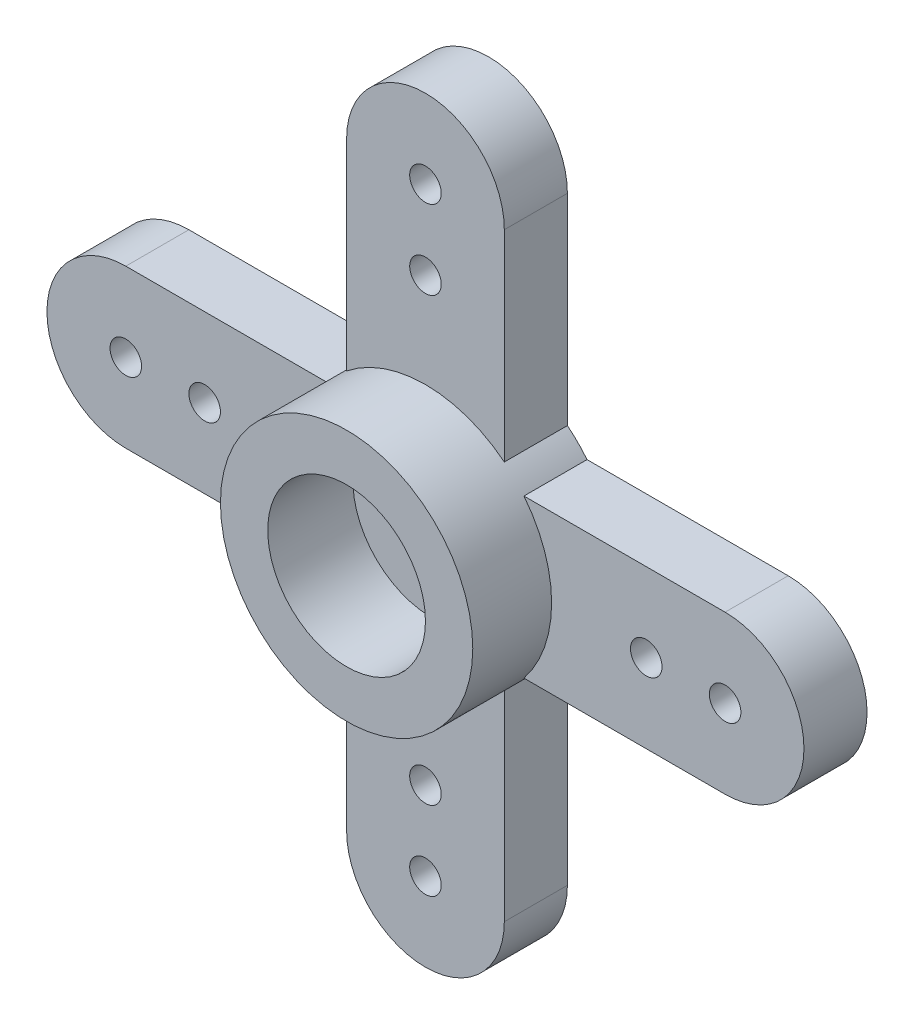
ISO-10303-21;
HEADER;
FILE_DESCRIPTION(('STEP AP214'),'2;1');
FILE_NAME('part.step','',(''),(''),'','','');
FILE_SCHEMA(('AUTOMOTIVE_DESIGN { 1 0 10303 214 1 1 1 1 }'));
ENDSEC;
DATA;
#1=APPLICATION_CONTEXT('core data for automotive mechanical design processes');
#2=APPLICATION_PROTOCOL_DEFINITION('international standard','automotive_design',2000,#1);
#3=PRODUCT_CONTEXT('',#1,'mechanical');
#4=PRODUCT('Part','Part','',(#3));
#5=PRODUCT_RELATED_PRODUCT_CATEGORY('part','',(#4));
#6=PRODUCT_DEFINITION_FORMATION('','',#4);
#7=PRODUCT_DEFINITION_CONTEXT('part definition',#1,'design');
#8=PRODUCT_DEFINITION('design','',#6,#7);
#9=PRODUCT_DEFINITION_SHAPE('','',#8);
#10=(LENGTH_UNIT() NAMED_UNIT(*) SI_UNIT(.MILLI.,.METRE.));
#11=(NAMED_UNIT(*) PLANE_ANGLE_UNIT() SI_UNIT($,.RADIAN.));
#12=(NAMED_UNIT(*) SI_UNIT($,.STERADIAN.) SOLID_ANGLE_UNIT());
#13=UNCERTAINTY_MEASURE_WITH_UNIT(LENGTH_MEASURE(1.E-05),#10,'distance_accuracy_value','');
#14=(GEOMETRIC_REPRESENTATION_CONTEXT(3) GLOBAL_UNCERTAINTY_ASSIGNED_CONTEXT((#13)) GLOBAL_UNIT_ASSIGNED_CONTEXT((#10,
#11,#12)) REPRESENTATION_CONTEXT('',''));
#15=CARTESIAN_POINT('',(0.,0.,0.));
#16=DIRECTION('',(0.,0.,1.));
#17=DIRECTION('',(1.,0.,0.));
#18=AXIS2_PLACEMENT_3D('',#15,#16,#17);
#19=CARTESIAN_POINT('',(0.,-9.5,2.));
#20=DIRECTION('',(0.,0.,1.));
#21=DIRECTION('',(1.,0.,0.));
#22=AXIS2_PLACEMENT_3D('',#19,#20,#21);
#23=PLANE('',#22);
#24=CARTESIAN_POINT('',(0.,0.,2.));
#25=DIRECTION('',(0.,0.,1.));
#26=DIRECTION('',(1.,0.,0.));
#27=AXIS2_PLACEMENT_3D('',#24,#25,#26);
#28=CIRCLE('',#27,4.);
#29=CARTESIAN_POINT('',(2.5,3.1224989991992,2.));
#30=VERTEX_POINT('',#29);
#31=CARTESIAN_POINT('',(-2.5,3.1224989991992,2.));
#32=VERTEX_POINT('',#31);
#33=EDGE_CURVE('E191',#30,#32,#28,.T.);
#34=ORIENTED_EDGE('',*,*,#33,.F.);
#35=DIRECTION('',(0.,1.,0.));
#36=VECTOR('',#35,1.);
#37=CARTESIAN_POINT('',(2.5,2.5,2.));
#38=LINE('',#37,#36);
#39=CARTESIAN_POINT('',(2.5,9.5,2.));
#40=VERTEX_POINT('',#39);
#41=EDGE_CURVE('E255',#30,#40,#38,.T.);
#42=ORIENTED_EDGE('',*,*,#41,.T.);
#43=CARTESIAN_POINT('',(0.,9.5,2.));
#44=DIRECTION('',(0.,0.,1.));
#45=DIRECTION('',(1.,0.,0.));
#46=AXIS2_PLACEMENT_3D('',#43,#44,#45);
#47=CIRCLE('',#46,2.5);
#48=CARTESIAN_POINT('',(-2.5,9.5,2.));
#49=VERTEX_POINT('',#48);
#50=EDGE_CURVE('E257',#40,#49,#47,.T.);
#51=ORIENTED_EDGE('',*,*,#50,.T.);
#52=DIRECTION('',(0.,-1.,0.));
#53=VECTOR('',#52,1.);
#54=CARTESIAN_POINT('',(-2.5,2.5,2.));
#55=LINE('',#54,#53);
#56=EDGE_CURVE('E259',#49,#32,#55,.T.);
#57=ORIENTED_EDGE('',*,*,#56,.T.);
#58=EDGE_LOOP('',(#34,#42,#51,#57));
#59=FACE_BOUND('',#58,.T.);
#60=CARTESIAN_POINT('',(0.,7.,2.));
#61=DIRECTION('',(0.,0.,1.));
#62=DIRECTION('',(1.,0.,0.));
#63=AXIS2_PLACEMENT_3D('',#60,#61,#62);
#64=CIRCLE('',#63,0.500000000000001);
#65=CARTESIAN_POINT('',(0.500000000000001,7.,2.));
#66=VERTEX_POINT('',#65);
#67=EDGE_CURVE('E211',#66,#66,#64,.T.);
#68=ORIENTED_EDGE('',*,*,#67,.F.);
#69=EDGE_LOOP('',(#68));
#70=FACE_BOUND('',#69,.T.);
#71=CARTESIAN_POINT('',(0.,9.5,2.));
#72=DIRECTION('',(0.,0.,1.));
#73=DIRECTION('',(1.,0.,0.));
#74=AXIS2_PLACEMENT_3D('',#71,#72,#73);
#75=CIRCLE('',#74,0.500000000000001);
#76=CARTESIAN_POINT('',(0.500000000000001,9.5,2.));
#77=VERTEX_POINT('',#76);
#78=EDGE_CURVE('E241',#77,#77,#75,.T.);
#79=ORIENTED_EDGE('',*,*,#78,.F.);
#80=EDGE_LOOP('',(#79));
#81=FACE_BOUND('',#80,.T.);
#82=ADVANCED_FACE('F34',(#59,#70,#81),#23,.T.);
#83=CARTESIAN_POINT('',(-3.1224989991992,2.5,2.));
#84=VERTEX_POINT('',#83);
#85=CARTESIAN_POINT('',(-3.1224989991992,-2.5,2.));
#86=VERTEX_POINT('',#85);
#87=EDGE_CURVE('E184',#84,#86,#28,.T.);
#88=ORIENTED_EDGE('',*,*,#87,.F.);
#89=DIRECTION('',(-1.,0.,0.));
#90=VECTOR('',#89,1.);
#91=CARTESIAN_POINT('',(-9.5,2.5,2.));
#92=LINE('',#91,#90);
#93=CARTESIAN_POINT('',(-9.5,2.5,2.));
#94=VERTEX_POINT('',#93);
#95=EDGE_CURVE('E262',#84,#94,#92,.T.);
#96=ORIENTED_EDGE('',*,*,#95,.T.);
#97=CARTESIAN_POINT('',(-9.5,0.,2.));
#98=DIRECTION('',(0.,0.,1.));
#99=DIRECTION('',(1.,0.,0.));
#100=AXIS2_PLACEMENT_3D('',#97,#98,#99);
#101=CIRCLE('',#100,2.5);
#102=CARTESIAN_POINT('',(-9.5,-2.5,2.));
#103=VERTEX_POINT('',#102);
#104=EDGE_CURVE('E264',#94,#103,#101,.T.);
#105=ORIENTED_EDGE('',*,*,#104,.T.);
#106=DIRECTION('',(1.,0.,0.));
#107=VECTOR('',#106,1.);
#108=CARTESIAN_POINT('',(-9.5,-2.5,2.));
#109=LINE('',#108,#107);
#110=EDGE_CURVE('E266',#103,#86,#109,.T.);
#111=ORIENTED_EDGE('',*,*,#110,.T.);
#112=EDGE_LOOP('',(#88,#96,#105,#111));
#113=FACE_BOUND('',#112,.T.);
#114=CARTESIAN_POINT('',(-7.,0.,2.));
#115=DIRECTION('',(0.,0.,1.));
#116=DIRECTION('',(1.,0.,0.));
#117=AXIS2_PLACEMENT_3D('',#114,#115,#116);
#118=CIRCLE('',#117,0.500000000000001);
#119=CARTESIAN_POINT('',(-6.5,0.,2.));
#120=VERTEX_POINT('',#119);
#121=EDGE_CURVE('E229',#120,#120,#118,.T.);
#122=ORIENTED_EDGE('',*,*,#121,.F.);
#123=EDGE_LOOP('',(#122));
#124=FACE_BOUND('',#123,.T.);
#125=CARTESIAN_POINT('',(-9.5,0.,2.));
#126=DIRECTION('',(0.,0.,1.));
#127=DIRECTION('',(1.,0.,0.));
#128=AXIS2_PLACEMENT_3D('',#125,#126,#127);
#129=CIRCLE('',#128,0.500000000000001);
#130=CARTESIAN_POINT('',(-9.,0.,2.));
#131=VERTEX_POINT('',#130);
#132=EDGE_CURVE('E235',#131,#131,#129,.T.);
#133=ORIENTED_EDGE('',*,*,#132,.F.);
#134=EDGE_LOOP('',(#133));
#135=FACE_BOUND('',#134,.T.);
#136=ADVANCED_FACE('F336',(#113,#124,#135),#23,.T.);
#137=CARTESIAN_POINT('',(-2.5,-3.1224989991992,2.));
#138=VERTEX_POINT('',#137);
#139=CARTESIAN_POINT('',(2.5,-3.1224989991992,2.));
#140=VERTEX_POINT('',#139);
#141=EDGE_CURVE('E175',#138,#140,#28,.T.);
#142=ORIENTED_EDGE('',*,*,#141,.F.);
#143=DIRECTION('',(0.,-1.,0.));
#144=VECTOR('',#143,1.);
#145=CARTESIAN_POINT('',(-2.5,-2.5,2.));
#146=LINE('',#145,#144);
#147=CARTESIAN_POINT('',(-2.5,-9.5,2.));
#148=VERTEX_POINT('',#147);
#149=EDGE_CURVE('E163',#138,#148,#146,.T.);
#150=ORIENTED_EDGE('',*,*,#149,.T.);
#151=CARTESIAN_POINT('',(0.,-9.5,2.));
#152=DIRECTION('',(0.,0.,1.));
#153=DIRECTION('',(1.,0.,0.));
#154=AXIS2_PLACEMENT_3D('',#151,#152,#153);
#155=CIRCLE('',#154,2.5);
#156=CARTESIAN_POINT('',(2.5,-9.5,2.));
#157=VERTEX_POINT('',#156);
#158=EDGE_CURVE('E270',#148,#157,#155,.T.);
#159=ORIENTED_EDGE('',*,*,#158,.T.);
#160=DIRECTION('',(0.,1.,0.));
#161=VECTOR('',#160,1.);
#162=CARTESIAN_POINT('',(2.5,-2.5,2.));
#163=LINE('',#162,#161);
#164=EDGE_CURVE('E246',#157,#140,#163,.T.);
#165=ORIENTED_EDGE('',*,*,#164,.T.);
#166=EDGE_LOOP('',(#142,#150,#159,#165));
#167=FACE_BOUND('',#166,.T.);
#168=CARTESIAN_POINT('',(0.,-9.5,2.));
#169=DIRECTION('',(0.,0.,1.));
#170=DIRECTION('',(1.,0.,0.));
#171=AXIS2_PLACEMENT_3D('',#168,#169,#170);
#172=CIRCLE('',#171,0.5);
#173=CARTESIAN_POINT('',(0.5,-9.5,2.));
#174=VERTEX_POINT('',#173);
#175=EDGE_CURVE('E199',#174,#174,#172,.T.);
#176=ORIENTED_EDGE('',*,*,#175,.F.);
#177=EDGE_LOOP('',(#176));
#178=FACE_BOUND('',#177,.T.);
#179=CARTESIAN_POINT('',(0.,-7.,2.));
#180=DIRECTION('',(0.,0.,1.));
#181=DIRECTION('',(1.,0.,0.));
#182=AXIS2_PLACEMENT_3D('',#179,#180,#181);
#183=CIRCLE('',#182,0.5);
#184=CARTESIAN_POINT('',(0.5,-7.,2.));
#185=VERTEX_POINT('',#184);
#186=EDGE_CURVE('E205',#185,#185,#183,.T.);
#187=ORIENTED_EDGE('',*,*,#186,.F.);
#188=EDGE_LOOP('',(#187));
#189=FACE_BOUND('',#188,.T.);
#190=ADVANCED_FACE('F379',(#167,#178,#189),#23,.T.);
#191=CARTESIAN_POINT('',(3.1224989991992,-2.5,2.));
#192=VERTEX_POINT('',#191);
#193=CARTESIAN_POINT('',(3.1224989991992,2.5,2.));
#194=VERTEX_POINT('',#193);
#195=EDGE_CURVE('E183',#192,#194,#28,.T.);
#196=ORIENTED_EDGE('',*,*,#195,.F.);
#197=DIRECTION('',(1.,0.,0.));
#198=VECTOR('',#197,1.);
#199=CARTESIAN_POINT('',(9.5,-2.5,2.));
#200=LINE('',#199,#198);
#201=CARTESIAN_POINT('',(9.5,-2.5,2.));
#202=VERTEX_POINT('',#201);
#203=EDGE_CURVE('E248',#192,#202,#200,.T.);
#204=ORIENTED_EDGE('',*,*,#203,.T.);
#205=CARTESIAN_POINT('',(9.5,0.,2.));
#206=DIRECTION('',(0.,0.,1.));
#207=DIRECTION('',(1.,0.,0.));
#208=AXIS2_PLACEMENT_3D('',#205,#206,#207);
#209=CIRCLE('',#208,2.5);
#210=CARTESIAN_POINT('',(9.5,2.5,2.));
#211=VERTEX_POINT('',#210);
#212=EDGE_CURVE('E250',#202,#211,#209,.T.);
#213=ORIENTED_EDGE('',*,*,#212,.T.);
#214=DIRECTION('',(-1.,0.,0.));
#215=VECTOR('',#214,1.);
#216=CARTESIAN_POINT('',(2.5,2.5,2.));
#217=LINE('',#216,#215);
#218=EDGE_CURVE('E252',#211,#194,#217,.T.);
#219=ORIENTED_EDGE('',*,*,#218,.T.);
#220=EDGE_LOOP('',(#196,#204,#213,#219));
#221=FACE_BOUND('',#220,.T.);
#222=CARTESIAN_POINT('',(9.5,0.,2.));
#223=DIRECTION('',(0.,0.,1.));
#224=DIRECTION('',(1.,0.,0.));
#225=AXIS2_PLACEMENT_3D('',#222,#223,#224);
#226=CIRCLE('',#225,0.500000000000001);
#227=CARTESIAN_POINT('',(10.,0.,2.));
#228=VERTEX_POINT('',#227);
#229=EDGE_CURVE('E217',#228,#228,#226,.T.);
#230=ORIENTED_EDGE('',*,*,#229,.F.);
#231=EDGE_LOOP('',(#230));
#232=FACE_BOUND('',#231,.T.);
#233=CARTESIAN_POINT('',(7.,0.,2.));
#234=DIRECTION('',(0.,0.,1.));
#235=DIRECTION('',(1.,0.,0.));
#236=AXIS2_PLACEMENT_3D('',#233,#234,#235);
#237=CIRCLE('',#236,0.500000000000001);
#238=CARTESIAN_POINT('',(7.5,0.,2.));
#239=VERTEX_POINT('',#238);
#240=EDGE_CURVE('E223',#239,#239,#237,.T.);
#241=ORIENTED_EDGE('',*,*,#240,.F.);
#242=EDGE_LOOP('',(#241));
#243=FACE_BOUND('',#242,.T.);
#244=ADVANCED_FACE('F375',(#221,#232,#243),#23,.T.);
#245=CARTESIAN_POINT('',(0.,-9.5,0.));
#246=DIRECTION('',(0.,0.,1.));
#247=DIRECTION('',(1.,0.,0.));
#248=AXIS2_PLACEMENT_3D('',#245,#246,#247);
#249=PLANE('',#248);
#250=CARTESIAN_POINT('',(9.5,0.,0.));
#251=DIRECTION('',(0.,0.,1.));
#252=DIRECTION('',(1.,0.,0.));
#253=AXIS2_PLACEMENT_3D('',#250,#251,#252);
#254=CIRCLE('',#253,0.500000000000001);
#255=CARTESIAN_POINT('',(10.,0.,0.));
#256=VERTEX_POINT('',#255);
#257=EDGE_CURVE('E214',#256,#256,#254,.T.);
#258=ORIENTED_EDGE('',*,*,#257,.T.);
#259=EDGE_LOOP('',(#258));
#260=FACE_BOUND('',#259,.T.);
#261=DIRECTION('',(1.,0.,0.));
#262=VECTOR('',#261,1.);
#263=CARTESIAN_POINT('',(9.5,-2.5,0.));
#264=LINE('',#263,#262);
#265=CARTESIAN_POINT('',(3.1224989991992,-2.5,0.));
#266=VERTEX_POINT('',#265);
#267=CARTESIAN_POINT('',(9.5,-2.5,0.));
#268=VERTEX_POINT('',#267);
#269=EDGE_CURVE('E274',#266,#268,#264,.T.);
#270=ORIENTED_EDGE('',*,*,#269,.F.);
#271=CARTESIAN_POINT('',(0.,0.,0.));
#272=DIRECTION('',(0.,0.,1.));
#273=DIRECTION('',(1.,0.,0.));
#274=AXIS2_PLACEMENT_3D('',#271,#272,#273);
#275=CIRCLE('',#274,4.);
#276=CARTESIAN_POINT('',(2.5,-3.1224989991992,0.));
#277=VERTEX_POINT('',#276);
#278=EDGE_CURVE('E171',#266,#277,#275,.F.);
#279=ORIENTED_EDGE('',*,*,#278,.T.);
#280=DIRECTION('',(0.,1.,0.));
#281=VECTOR('',#280,1.);
#282=CARTESIAN_POINT('',(2.5,-2.5,0.));
#283=LINE('',#282,#281);
#284=CARTESIAN_POINT('',(2.5,-9.5,0.));
#285=VERTEX_POINT('',#284);
#286=EDGE_CURVE('E54',#285,#277,#283,.T.);
#287=ORIENTED_EDGE('',*,*,#286,.F.);
#288=CARTESIAN_POINT('',(0.,-9.5,0.));
#289=DIRECTION('',(0.,0.,1.));
#290=DIRECTION('',(1.,0.,0.));
#291=AXIS2_PLACEMENT_3D('',#288,#289,#290);
#292=CIRCLE('',#291,2.5);
#293=CARTESIAN_POINT('',(-2.5,-9.5,0.));
#294=VERTEX_POINT('',#293);
#295=EDGE_CURVE('E154',#294,#285,#292,.T.);
#296=ORIENTED_EDGE('',*,*,#295,.F.);
#297=DIRECTION('',(0.,-1.,0.));
#298=VECTOR('',#297,1.);
#299=CARTESIAN_POINT('',(-2.5,-2.5,0.));
#300=LINE('',#299,#298);
#301=CARTESIAN_POINT('',(-2.5,-3.1224989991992,0.));
#302=VERTEX_POINT('',#301);
#303=EDGE_CURVE('E147',#302,#294,#300,.T.);
#304=ORIENTED_EDGE('',*,*,#303,.F.);
#305=CARTESIAN_POINT('',(-3.1224989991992,-2.5,0.));
#306=VERTEX_POINT('',#305);
#307=EDGE_CURVE('E153',#302,#306,#275,.F.);
#308=ORIENTED_EDGE('',*,*,#307,.T.);
#309=DIRECTION('',(1.,0.,0.));
#310=VECTOR('',#309,1.);
#311=CARTESIAN_POINT('',(-9.5,-2.5,0.));
#312=LINE('',#311,#310);
#313=CARTESIAN_POINT('',(-9.5,-2.5,0.));
#314=VERTEX_POINT('',#313);
#315=EDGE_CURVE('E158',#314,#306,#312,.T.);
#316=ORIENTED_EDGE('',*,*,#315,.F.);
#317=CARTESIAN_POINT('',(-9.5,0.,0.));
#318=DIRECTION('',(0.,0.,1.));
#319=DIRECTION('',(1.,0.,0.));
#320=AXIS2_PLACEMENT_3D('',#317,#318,#319);
#321=CIRCLE('',#320,2.5);
#322=CARTESIAN_POINT('',(-9.5,2.5,0.));
#323=VERTEX_POINT('',#322);
#324=EDGE_CURVE('E288',#323,#314,#321,.T.);
#325=ORIENTED_EDGE('',*,*,#324,.F.);
#326=DIRECTION('',(-1.,0.,0.));
#327=VECTOR('',#326,1.);
#328=CARTESIAN_POINT('',(-9.5,2.5,0.));
#329=LINE('',#328,#327);
#330=CARTESIAN_POINT('',(-3.1224989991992,2.5,0.));
#331=VERTEX_POINT('',#330);
#332=EDGE_CURVE('E286',#331,#323,#329,.T.);
#333=ORIENTED_EDGE('',*,*,#332,.F.);
#334=CARTESIAN_POINT('',(-2.5,3.1224989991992,0.));
#335=VERTEX_POINT('',#334);
#336=EDGE_CURVE('E172',#331,#335,#275,.F.);
#337=ORIENTED_EDGE('',*,*,#336,.T.);
#338=DIRECTION('',(0.,-1.,0.));
#339=VECTOR('',#338,1.);
#340=CARTESIAN_POINT('',(-2.5,2.5,0.));
#341=LINE('',#340,#339);
#342=CARTESIAN_POINT('',(-2.5,9.5,0.));
#343=VERTEX_POINT('',#342);
#344=EDGE_CURVE('E284',#343,#335,#341,.T.);
#345=ORIENTED_EDGE('',*,*,#344,.F.);
#346=CARTESIAN_POINT('',(0.,9.5,0.));
#347=DIRECTION('',(0.,0.,1.));
#348=DIRECTION('',(1.,0.,0.));
#349=AXIS2_PLACEMENT_3D('',#346,#347,#348);
#350=CIRCLE('',#349,2.5);
#351=CARTESIAN_POINT('',(2.5,9.5,0.));
#352=VERTEX_POINT('',#351);
#353=EDGE_CURVE('E282',#352,#343,#350,.T.);
#354=ORIENTED_EDGE('',*,*,#353,.F.);
#355=DIRECTION('',(0.,1.,0.));
#356=VECTOR('',#355,1.);
#357=CARTESIAN_POINT('',(2.5,2.5,0.));
#358=LINE('',#357,#356);
#359=CARTESIAN_POINT('',(2.5,3.1224989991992,0.));
#360=VERTEX_POINT('',#359);
#361=EDGE_CURVE('E280',#360,#352,#358,.T.);
#362=ORIENTED_EDGE('',*,*,#361,.F.);
#363=CARTESIAN_POINT('',(3.1224989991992,2.5,0.));
#364=VERTEX_POINT('',#363);
#365=EDGE_CURVE('E176',#360,#364,#275,.F.);
#366=ORIENTED_EDGE('',*,*,#365,.T.);
#367=DIRECTION('',(-1.,0.,0.));
#368=VECTOR('',#367,1.);
#369=CARTESIAN_POINT('',(2.5,2.5,0.));
#370=LINE('',#369,#368);
#371=CARTESIAN_POINT('',(9.5,2.5,0.));
#372=VERTEX_POINT('',#371);
#373=EDGE_CURVE('E278',#372,#364,#370,.T.);
#374=ORIENTED_EDGE('',*,*,#373,.F.);
#375=CARTESIAN_POINT('',(9.5,0.,0.));
#376=DIRECTION('',(0.,0.,1.));
#377=DIRECTION('',(1.,0.,0.));
#378=AXIS2_PLACEMENT_3D('',#375,#376,#377);
#379=CIRCLE('',#378,2.5);
#380=EDGE_CURVE('E276',#268,#372,#379,.T.);
#381=ORIENTED_EDGE('',*,*,#380,.F.);
#382=EDGE_LOOP('',(#270,#279,#287,#296,#304,#308,#316,#325,#333,#337,#345,#354,#362,#366,#374,#381));
#383=FACE_BOUND('',#382,.T.);
#384=CARTESIAN_POINT('',(7.,0.,0.));
#385=DIRECTION('',(0.,0.,1.));
#386=DIRECTION('',(1.,0.,0.));
#387=AXIS2_PLACEMENT_3D('',#384,#385,#386);
#388=CIRCLE('',#387,0.500000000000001);
#389=CARTESIAN_POINT('',(7.5,0.,0.));
#390=VERTEX_POINT('',#389);
#391=EDGE_CURVE('E220',#390,#390,#388,.T.);
#392=ORIENTED_EDGE('',*,*,#391,.T.);
#393=EDGE_LOOP('',(#392));
#394=FACE_BOUND('',#393,.T.);
#395=CARTESIAN_POINT('',(0.,-9.5,0.));
#396=DIRECTION('',(0.,0.,1.));
#397=DIRECTION('',(1.,0.,0.));
#398=AXIS2_PLACEMENT_3D('',#395,#396,#397);
#399=CIRCLE('',#398,0.5);
#400=CARTESIAN_POINT('',(0.5,-9.5,0.));
#401=VERTEX_POINT('',#400);
#402=EDGE_CURVE('E198',#401,#401,#399,.T.);
#403=ORIENTED_EDGE('',*,*,#402,.T.);
#404=EDGE_LOOP('',(#403));
#405=FACE_BOUND('',#404,.T.);
#406=CARTESIAN_POINT('',(0.,-7.,0.));
#407=DIRECTION('',(0.,0.,1.));
#408=DIRECTION('',(1.,0.,0.));
#409=AXIS2_PLACEMENT_3D('',#406,#407,#408);
#410=CIRCLE('',#409,0.5);
#411=CARTESIAN_POINT('',(0.5,-7.,0.));
#412=VERTEX_POINT('',#411);
#413=EDGE_CURVE('E202',#412,#412,#410,.T.);
#414=ORIENTED_EDGE('',*,*,#413,.T.);
#415=EDGE_LOOP('',(#414));
#416=FACE_BOUND('',#415,.T.);
#417=CARTESIAN_POINT('',(-7.,0.,0.));
#418=DIRECTION('',(0.,0.,1.));
#419=DIRECTION('',(1.,0.,0.));
#420=AXIS2_PLACEMENT_3D('',#417,#418,#419);
#421=CIRCLE('',#420,0.500000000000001);
#422=CARTESIAN_POINT('',(-6.5,0.,0.));
#423=VERTEX_POINT('',#422);
#424=EDGE_CURVE('E226',#423,#423,#421,.T.);
#425=ORIENTED_EDGE('',*,*,#424,.T.);
#426=EDGE_LOOP('',(#425));
#427=FACE_BOUND('',#426,.T.);
#428=CARTESIAN_POINT('',(-9.5,0.,0.));
#429=DIRECTION('',(0.,0.,1.));
#430=DIRECTION('',(1.,0.,0.));
#431=AXIS2_PLACEMENT_3D('',#428,#429,#430);
#432=CIRCLE('',#431,0.500000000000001);
#433=CARTESIAN_POINT('',(-9.,0.,0.));
#434=VERTEX_POINT('',#433);
#435=EDGE_CURVE('E232',#434,#434,#432,.T.);
#436=ORIENTED_EDGE('',*,*,#435,.T.);
#437=EDGE_LOOP('',(#436));
#438=FACE_BOUND('',#437,.T.);
#439=CARTESIAN_POINT('',(0.,7.,0.));
#440=DIRECTION('',(0.,0.,1.));
#441=DIRECTION('',(1.,0.,0.));
#442=AXIS2_PLACEMENT_3D('',#439,#440,#441);
#443=CIRCLE('',#442,0.500000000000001);
#444=CARTESIAN_POINT('',(0.500000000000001,7.,0.));
#445=VERTEX_POINT('',#444);
#446=EDGE_CURVE('E208',#445,#445,#443,.T.);
#447=ORIENTED_EDGE('',*,*,#446,.T.);
#448=EDGE_LOOP('',(#447));
#449=FACE_BOUND('',#448,.T.);
#450=CARTESIAN_POINT('',(0.,9.5,0.));
#451=DIRECTION('',(0.,0.,1.));
#452=DIRECTION('',(1.,0.,0.));
#453=AXIS2_PLACEMENT_3D('',#450,#451,#452);
#454=CIRCLE('',#453,0.500000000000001);
#455=CARTESIAN_POINT('',(0.500000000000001,9.5,0.));
#456=VERTEX_POINT('',#455);
#457=EDGE_CURVE('E238',#456,#456,#454,.T.);
#458=ORIENTED_EDGE('',*,*,#457,.T.);
#459=EDGE_LOOP('',(#458));
#460=FACE_BOUND('',#459,.T.);
#461=ADVANCED_FACE('F149',(#260,#383,#394,#405,#416,#427,#438,#449,#460),#249,.F.);
#462=CARTESIAN_POINT('',(2.5,-2.5,2.));
#463=DIRECTION('',(-1.,0.,0.));
#464=DIRECTION('',(0.,-1.,0.));
#465=AXIS2_PLACEMENT_3D('',#462,#463,#464);
#466=PLANE('',#465);
#467=ORIENTED_EDGE('',*,*,#286,.T.);
#468=DIRECTION('',(0.,0.,1.));
#469=VECTOR('',#468,1.);
#470=CARTESIAN_POINT('',(2.5,-3.1224989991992,-11.3137084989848));
#471=LINE('',#470,#469);
#472=EDGE_CURVE('E49',#277,#140,#471,.T.);
#473=ORIENTED_EDGE('',*,*,#472,.T.);
#474=ORIENTED_EDGE('',*,*,#164,.F.);
#475=DIRECTION('',(0.,0.,-1.));
#476=VECTOR('',#475,1.);
#477=CARTESIAN_POINT('',(2.5,-9.5,2.));
#478=LINE('',#477,#476);
#479=EDGE_CURVE('E272',#157,#285,#478,.T.);
#480=ORIENTED_EDGE('',*,*,#479,.T.);
#481=EDGE_LOOP('',(#467,#473,#474,#480));
#482=FACE_BOUND('',#481,.T.);
#483=ADVANCED_FACE('F36',(#482),#466,.F.);
#484=CARTESIAN_POINT('',(9.5,-2.5,2.));
#485=DIRECTION('',(0.,1.,0.));
#486=DIRECTION('',(0.,0.,1.));
#487=AXIS2_PLACEMENT_3D('',#484,#485,#486);
#488=PLANE('',#487);
#489=ORIENTED_EDGE('',*,*,#203,.F.);
#490=DIRECTION('',(0.,0.,1.));
#491=VECTOR('',#490,1.);
#492=CARTESIAN_POINT('',(3.1224989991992,-2.5,-11.3137084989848));
#493=LINE('',#492,#491);
#494=EDGE_CURVE('E196',#192,#266,#493,.F.);
#495=ORIENTED_EDGE('',*,*,#494,.T.);
#496=ORIENTED_EDGE('',*,*,#269,.T.);
#497=DIRECTION('',(0.,0.,-1.));
#498=VECTOR('',#497,1.);
#499=CARTESIAN_POINT('',(9.5,-2.5,2.));
#500=LINE('',#499,#498);
#501=EDGE_CURVE('E42',#202,#268,#500,.T.);
#502=ORIENTED_EDGE('',*,*,#501,.F.);
#503=EDGE_LOOP('',(#489,#495,#496,#502));
#504=FACE_BOUND('',#503,.T.);
#505=ADVANCED_FACE('F555',(#504),#488,.F.);
#506=CARTESIAN_POINT('',(9.5,0.,2.));
#507=DIRECTION('',(0.,0.,-1.));
#508=DIRECTION('',(-1.,0.,0.));
#509=AXIS2_PLACEMENT_3D('',#506,#507,#508);
#510=CYLINDRICAL_SURFACE('',#509,2.5);
#511=ORIENTED_EDGE('',*,*,#380,.T.);
#512=DIRECTION('',(0.,0.,-1.));
#513=VECTOR('',#512,1.);
#514=CARTESIAN_POINT('',(9.5,2.5,2.));
#515=LINE('',#514,#513);
#516=EDGE_CURVE('E307',#211,#372,#515,.T.);
#517=ORIENTED_EDGE('',*,*,#516,.F.);
#518=ORIENTED_EDGE('',*,*,#212,.F.);
#519=ORIENTED_EDGE('',*,*,#501,.T.);
#520=EDGE_LOOP('',(#511,#517,#518,#519));
#521=FACE_BOUND('',#520,.T.);
#522=ADVANCED_FACE('F314',(#521),#510,.T.);
#523=CARTESIAN_POINT('',(2.5,2.5,2.));
#524=DIRECTION('',(0.,-1.,0.));
#525=DIRECTION('',(1.,0.,0.));
#526=AXIS2_PLACEMENT_3D('',#523,#524,#525);
#527=PLANE('',#526);
#528=ORIENTED_EDGE('',*,*,#373,.T.);
#529=DIRECTION('',(0.,0.,1.));
#530=VECTOR('',#529,1.);
#531=CARTESIAN_POINT('',(3.1224989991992,2.5,-11.3137084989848));
#532=LINE('',#531,#530);
#533=EDGE_CURVE('E194',#364,#194,#532,.T.);
#534=ORIENTED_EDGE('',*,*,#533,.T.);
#535=ORIENTED_EDGE('',*,*,#218,.F.);
#536=ORIENTED_EDGE('',*,*,#516,.T.);
#537=EDGE_LOOP('',(#528,#534,#535,#536));
#538=FACE_BOUND('',#537,.T.);
#539=ADVANCED_FACE('F325',(#538),#527,.F.);
#540=CARTESIAN_POINT('',(2.5,2.5,2.));
#541=DIRECTION('',(-1.,0.,0.));
#542=DIRECTION('',(0.,0.,1.));
#543=AXIS2_PLACEMENT_3D('',#540,#541,#542);
#544=PLANE('',#543);
#545=ORIENTED_EDGE('',*,*,#41,.F.);
#546=DIRECTION('',(0.,0.,1.));
#547=VECTOR('',#546,1.);
#548=CARTESIAN_POINT('',(2.5,3.1224989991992,-11.3137084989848));
#549=LINE('',#548,#547);
#550=EDGE_CURVE('E192',#30,#360,#549,.F.);
#551=ORIENTED_EDGE('',*,*,#550,.T.);
#552=ORIENTED_EDGE('',*,*,#361,.T.);
#553=DIRECTION('',(0.,0.,-1.));
#554=VECTOR('',#553,1.);
#555=CARTESIAN_POINT('',(2.5,9.5,2.));
#556=LINE('',#555,#554);
#557=EDGE_CURVE('E304',#40,#352,#556,.T.);
#558=ORIENTED_EDGE('',*,*,#557,.F.);
#559=EDGE_LOOP('',(#545,#551,#552,#558));
#560=FACE_BOUND('',#559,.T.);
#561=ADVANCED_FACE('F364',(#560),#544,.F.);
#562=CARTESIAN_POINT('',(0.,9.5,2.));
#563=DIRECTION('',(0.,0.,-1.));
#564=DIRECTION('',(-1.,0.,0.));
#565=AXIS2_PLACEMENT_3D('',#562,#563,#564);
#566=CYLINDRICAL_SURFACE('',#565,2.5);
#567=ORIENTED_EDGE('',*,*,#353,.T.);
#568=DIRECTION('',(0.,0.,-1.));
#569=VECTOR('',#568,1.);
#570=CARTESIAN_POINT('',(-2.5,9.5,2.));
#571=LINE('',#570,#569);
#572=EDGE_CURVE('E301',#49,#343,#571,.T.);
#573=ORIENTED_EDGE('',*,*,#572,.F.);
#574=ORIENTED_EDGE('',*,*,#50,.F.);
#575=ORIENTED_EDGE('',*,*,#557,.T.);
#576=EDGE_LOOP('',(#567,#573,#574,#575));
#577=FACE_BOUND('',#576,.T.);
#578=ADVANCED_FACE('F361',(#577),#566,.T.);
#579=CARTESIAN_POINT('',(-2.5,2.5,2.));
#580=DIRECTION('',(1.,0.,0.));
#581=DIRECTION('',(0.,0.,-1.));
#582=AXIS2_PLACEMENT_3D('',#579,#580,#581);
#583=PLANE('',#582);
#584=ORIENTED_EDGE('',*,*,#344,.T.);
#585=DIRECTION('',(0.,0.,1.));
#586=VECTOR('',#585,1.);
#587=CARTESIAN_POINT('',(-2.5,3.1224989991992,-11.3137084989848));
#588=LINE('',#587,#586);
#589=EDGE_CURVE('E189',#335,#32,#588,.T.);
#590=ORIENTED_EDGE('',*,*,#589,.T.);
#591=ORIENTED_EDGE('',*,*,#56,.F.);
#592=ORIENTED_EDGE('',*,*,#572,.T.);
#593=EDGE_LOOP('',(#584,#590,#591,#592));
#594=FACE_BOUND('',#593,.T.);
#595=ADVANCED_FACE('F353',(#594),#583,.F.);
#596=CARTESIAN_POINT('',(-9.5,2.5,2.));
#597=DIRECTION('',(0.,-1.,0.));
#598=DIRECTION('',(1.,0.,0.));
#599=AXIS2_PLACEMENT_3D('',#596,#597,#598);
#600=PLANE('',#599);
#601=ORIENTED_EDGE('',*,*,#95,.F.);
#602=DIRECTION('',(0.,0.,1.));
#603=VECTOR('',#602,1.);
#604=CARTESIAN_POINT('',(-3.1224989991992,2.5,-11.3137084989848));
#605=LINE('',#604,#603);
#606=EDGE_CURVE('E187',#84,#331,#605,.F.);
#607=ORIENTED_EDGE('',*,*,#606,.T.);
#608=ORIENTED_EDGE('',*,*,#332,.T.);
#609=DIRECTION('',(0.,0.,-1.));
#610=VECTOR('',#609,1.);
#611=CARTESIAN_POINT('',(-9.5,2.5,2.));
#612=LINE('',#611,#610);
#613=EDGE_CURVE('E298',#94,#323,#612,.T.);
#614=ORIENTED_EDGE('',*,*,#613,.F.);
#615=EDGE_LOOP('',(#601,#607,#608,#614));
#616=FACE_BOUND('',#615,.T.);
#617=ADVANCED_FACE('F341',(#616),#600,.F.);
#618=CARTESIAN_POINT('',(-9.5,0.,2.));
#619=DIRECTION('',(0.,0.,-1.));
#620=DIRECTION('',(-1.,0.,0.));
#621=AXIS2_PLACEMENT_3D('',#618,#619,#620);
#622=CYLINDRICAL_SURFACE('',#621,2.5);
#623=ORIENTED_EDGE('',*,*,#324,.T.);
#624=DIRECTION('',(0.,0.,-1.));
#625=VECTOR('',#624,1.);
#626=CARTESIAN_POINT('',(-9.5,-2.5,2.));
#627=LINE('',#626,#625);
#628=EDGE_CURVE('E295',#103,#314,#627,.T.);
#629=ORIENTED_EDGE('',*,*,#628,.F.);
#630=ORIENTED_EDGE('',*,*,#104,.F.);
#631=ORIENTED_EDGE('',*,*,#613,.T.);
#632=EDGE_LOOP('',(#623,#629,#630,#631));
#633=FACE_BOUND('',#632,.T.);
#634=ADVANCED_FACE('F347',(#633),#622,.T.);
#635=CARTESIAN_POINT('',(-9.5,-2.5,2.));
#636=DIRECTION('',(0.,1.,0.));
#637=DIRECTION('',(-1.,0.,0.));
#638=AXIS2_PLACEMENT_3D('',#635,#636,#637);
#639=PLANE('',#638);
#640=ORIENTED_EDGE('',*,*,#315,.T.);
#641=DIRECTION('',(0.,0.,1.));
#642=VECTOR('',#641,1.);
#643=CARTESIAN_POINT('',(-3.1224989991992,-2.5,-11.3137084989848));
#644=LINE('',#643,#642);
#645=EDGE_CURVE('E170',#306,#86,#644,.T.);
#646=ORIENTED_EDGE('',*,*,#645,.T.);
#647=ORIENTED_EDGE('',*,*,#110,.F.);
#648=ORIENTED_EDGE('',*,*,#628,.T.);
#649=EDGE_LOOP('',(#640,#646,#647,#648));
#650=FACE_BOUND('',#649,.T.);
#651=ADVANCED_FACE('F349',(#650),#639,.F.);
#652=CARTESIAN_POINT('',(-2.5,-2.5,2.));
#653=DIRECTION('',(1.,0.,0.));
#654=DIRECTION('',(0.,1.,0.));
#655=AXIS2_PLACEMENT_3D('',#652,#653,#654);
#656=PLANE('',#655);
#657=ORIENTED_EDGE('',*,*,#149,.F.);
#658=DIRECTION('',(0.,0.,1.));
#659=VECTOR('',#658,1.);
#660=CARTESIAN_POINT('',(-2.5,-3.1224989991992,-11.3137084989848));
#661=LINE('',#660,#659);
#662=EDGE_CURVE('E11',#138,#302,#661,.F.);
#663=ORIENTED_EDGE('',*,*,#662,.T.);
#664=ORIENTED_EDGE('',*,*,#303,.T.);
#665=DIRECTION('',(0.,0.,-1.));
#666=VECTOR('',#665,1.);
#667=CARTESIAN_POINT('',(-2.5,-9.5,2.));
#668=LINE('',#667,#666);
#669=EDGE_CURVE('E293',#148,#294,#668,.T.);
#670=ORIENTED_EDGE('',*,*,#669,.F.);
#671=EDGE_LOOP('',(#657,#663,#664,#670));
#672=FACE_BOUND('',#671,.T.);
#673=ADVANCED_FACE('F162',(#672),#656,.F.);
#674=CARTESIAN_POINT('',(0.,-9.5,2.));
#675=DIRECTION('',(0.,0.,-1.));
#676=DIRECTION('',(-1.,0.,0.));
#677=AXIS2_PLACEMENT_3D('',#674,#675,#676);
#678=CYLINDRICAL_SURFACE('',#677,2.5);
#679=ORIENTED_EDGE('',*,*,#295,.T.);
#680=ORIENTED_EDGE('',*,*,#479,.F.);
#681=ORIENTED_EDGE('',*,*,#158,.F.);
#682=ORIENTED_EDGE('',*,*,#669,.T.);
#683=EDGE_LOOP('',(#679,#680,#681,#682));
#684=FACE_BOUND('',#683,.T.);
#685=ADVANCED_FACE('F417',(#684),#678,.T.);
#686=CARTESIAN_POINT('',(0.,9.5,2.));
#687=DIRECTION('',(0.,0.,-1.));
#688=DIRECTION('',(-1.,0.,0.));
#689=AXIS2_PLACEMENT_3D('',#686,#687,#688);
#690=CYLINDRICAL_SURFACE('',#689,0.500000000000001);
#691=ORIENTED_EDGE('',*,*,#78,.T.);
#692=EDGE_LOOP('',(#691));
#693=FACE_BOUND('',#692,.T.);
#694=ORIENTED_EDGE('',*,*,#457,.F.);
#695=EDGE_LOOP('',(#694));
#696=FACE_BOUND('',#695,.T.);
#697=ADVANCED_FACE('F414',(#693,#696),#690,.F.);
#698=CARTESIAN_POINT('',(-9.5,0.,2.));
#699=DIRECTION('',(0.,0.,-1.));
#700=DIRECTION('',(-1.,0.,0.));
#701=AXIS2_PLACEMENT_3D('',#698,#699,#700);
#702=CYLINDRICAL_SURFACE('',#701,0.500000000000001);
#703=ORIENTED_EDGE('',*,*,#132,.T.);
#704=EDGE_LOOP('',(#703));
#705=FACE_BOUND('',#704,.T.);
#706=ORIENTED_EDGE('',*,*,#435,.F.);
#707=EDGE_LOOP('',(#706));
#708=FACE_BOUND('',#707,.T.);
#709=ADVANCED_FACE('F416',(#705,#708),#702,.F.);
#710=CARTESIAN_POINT('',(-7.,0.,2.));
#711=DIRECTION('',(0.,0.,-1.));
#712=DIRECTION('',(-1.,0.,0.));
#713=AXIS2_PLACEMENT_3D('',#710,#711,#712);
#714=CYLINDRICAL_SURFACE('',#713,0.500000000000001);
#715=ORIENTED_EDGE('',*,*,#121,.T.);
#716=EDGE_LOOP('',(#715));
#717=FACE_BOUND('',#716,.T.);
#718=ORIENTED_EDGE('',*,*,#424,.F.);
#719=EDGE_LOOP('',(#718));
#720=FACE_BOUND('',#719,.T.);
#721=ADVANCED_FACE('F398',(#717,#720),#714,.F.);
#722=CARTESIAN_POINT('',(7.,0.,2.));
#723=DIRECTION('',(0.,0.,-1.));
#724=DIRECTION('',(-1.,0.,0.));
#725=AXIS2_PLACEMENT_3D('',#722,#723,#724);
#726=CYLINDRICAL_SURFACE('',#725,0.500000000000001);
#727=ORIENTED_EDGE('',*,*,#240,.T.);
#728=EDGE_LOOP('',(#727));
#729=FACE_BOUND('',#728,.T.);
#730=ORIENTED_EDGE('',*,*,#391,.F.);
#731=EDGE_LOOP('',(#730));
#732=FACE_BOUND('',#731,.T.);
#733=ADVANCED_FACE('F394',(#729,#732),#726,.F.);
#734=CARTESIAN_POINT('',(9.5,0.,2.));
#735=DIRECTION('',(0.,0.,-1.));
#736=DIRECTION('',(-1.,0.,0.));
#737=AXIS2_PLACEMENT_3D('',#734,#735,#736);
#738=CYLINDRICAL_SURFACE('',#737,0.500000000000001);
#739=ORIENTED_EDGE('',*,*,#229,.T.);
#740=EDGE_LOOP('',(#739));
#741=FACE_BOUND('',#740,.T.);
#742=ORIENTED_EDGE('',*,*,#257,.F.);
#743=EDGE_LOOP('',(#742));
#744=FACE_BOUND('',#743,.T.);
#745=ADVANCED_FACE('F397',(#741,#744),#738,.F.);
#746=CARTESIAN_POINT('',(0.,7.,2.));
#747=DIRECTION('',(0.,0.,-1.));
#748=DIRECTION('',(-1.,0.,0.));
#749=AXIS2_PLACEMENT_3D('',#746,#747,#748);
#750=CYLINDRICAL_SURFACE('',#749,0.500000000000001);
#751=ORIENTED_EDGE('',*,*,#67,.T.);
#752=EDGE_LOOP('',(#751));
#753=FACE_BOUND('',#752,.T.);
#754=ORIENTED_EDGE('',*,*,#446,.F.);
#755=EDGE_LOOP('',(#754));
#756=FACE_BOUND('',#755,.T.);
#757=ADVANCED_FACE('F433',(#753,#756),#750,.F.);
#758=CARTESIAN_POINT('',(0.,-7.,2.));
#759=DIRECTION('',(0.,0.,-1.));
#760=DIRECTION('',(-1.,0.,0.));
#761=AXIS2_PLACEMENT_3D('',#758,#759,#760);
#762=CYLINDRICAL_SURFACE('',#761,0.5);
#763=ORIENTED_EDGE('',*,*,#186,.T.);
#764=EDGE_LOOP('',(#763));
#765=FACE_BOUND('',#764,.T.);
#766=ORIENTED_EDGE('',*,*,#413,.F.);
#767=EDGE_LOOP('',(#766));
#768=FACE_BOUND('',#767,.T.);
#769=ADVANCED_FACE('F437',(#765,#768),#762,.F.);
#770=CARTESIAN_POINT('',(0.,-9.5,2.));
#771=DIRECTION('',(0.,0.,-1.));
#772=DIRECTION('',(-1.,0.,0.));
#773=AXIS2_PLACEMENT_3D('',#770,#771,#772);
#774=CYLINDRICAL_SURFACE('',#773,0.5);
#775=ORIENTED_EDGE('',*,*,#175,.T.);
#776=EDGE_LOOP('',(#775));
#777=FACE_BOUND('',#776,.T.);
#778=ORIENTED_EDGE('',*,*,#402,.F.);
#779=EDGE_LOOP('',(#778));
#780=FACE_BOUND('',#779,.T.);
#781=ADVANCED_FACE('F441',(#777,#780),#774,.F.);
#782=CARTESIAN_POINT('',(0.,0.,-11.3137084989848));
#783=DIRECTION('',(0.,0.,1.));
#784=DIRECTION('',(1.,0.,0.));
#785=AXIS2_PLACEMENT_3D('',#782,#783,#784);
#786=CYLINDRICAL_SURFACE('',#785,4.);
#787=CARTESIAN_POINT('',(0.,0.,4.5));
#788=DIRECTION('',(0.,0.,1.));
#789=DIRECTION('',(1.,0.,0.));
#790=AXIS2_PLACEMENT_3D('',#787,#788,#789);
#791=CIRCLE('',#790,4.);
#792=CARTESIAN_POINT('',(4.,0.,4.5));
#793=VERTEX_POINT('',#792);
#794=EDGE_CURVE('E180',#793,#793,#791,.T.);
#795=ORIENTED_EDGE('',*,*,#794,.F.);
#796=EDGE_LOOP('',(#795));
#797=FACE_BOUND('',#796,.T.);
#798=ORIENTED_EDGE('',*,*,#494,.F.);
#799=ORIENTED_EDGE('',*,*,#195,.T.);
#800=ORIENTED_EDGE('',*,*,#533,.F.);
#801=ORIENTED_EDGE('',*,*,#365,.F.);
#802=ORIENTED_EDGE('',*,*,#550,.F.);
#803=ORIENTED_EDGE('',*,*,#33,.T.);
#804=ORIENTED_EDGE('',*,*,#589,.F.);
#805=ORIENTED_EDGE('',*,*,#336,.F.);
#806=ORIENTED_EDGE('',*,*,#606,.F.);
#807=ORIENTED_EDGE('',*,*,#87,.T.);
#808=ORIENTED_EDGE('',*,*,#645,.F.);
#809=ORIENTED_EDGE('',*,*,#307,.F.);
#810=ORIENTED_EDGE('',*,*,#662,.F.);
#811=ORIENTED_EDGE('',*,*,#141,.T.);
#812=ORIENTED_EDGE('',*,*,#472,.F.);
#813=ORIENTED_EDGE('',*,*,#278,.F.);
#814=EDGE_LOOP('',(#798,#799,#800,#801,#802,#803,#804,#805,#806,#807,#808,#809,#810,#811,#812,#813));
#815=FACE_BOUND('',#814,.T.);
#816=ADVANCED_FACE('F168',(#797,#815),#786,.T.);
#817=CARTESIAN_POINT('',(0.,0.,4.5));
#818=DIRECTION('',(0.,0.,1.));
#819=DIRECTION('',(1.,0.,0.));
#820=AXIS2_PLACEMENT_3D('',#817,#818,#819);
#821=PLANE('',#820);
#822=CARTESIAN_POINT('',(0.,0.,4.5));
#823=DIRECTION('',(0.,0.,1.));
#824=DIRECTION('',(1.,0.,0.));
#825=AXIS2_PLACEMENT_3D('',#822,#823,#824);
#826=CIRCLE('',#825,2.5);
#827=CARTESIAN_POINT('',(2.5,0.,4.5));
#828=VERTEX_POINT('',#827);
#829=EDGE_CURVE('E465',#828,#828,#826,.T.);
#830=ORIENTED_EDGE('',*,*,#829,.F.);
#831=EDGE_LOOP('',(#830));
#832=FACE_BOUND('',#831,.T.);
#833=ORIENTED_EDGE('',*,*,#794,.T.);
#834=EDGE_LOOP('',(#833));
#835=FACE_BOUND('',#834,.T.);
#836=ADVANCED_FACE('F448',(#832,#835),#821,.T.);
#837=CARTESIAN_POINT('',(0.,0.,1.8));
#838=DIRECTION('',(0.,0.,1.));
#839=DIRECTION('',(1.,0.,0.));
#840=AXIS2_PLACEMENT_3D('',#837,#838,#839);
#841=CYLINDRICAL_SURFACE('',#840,2.5);
#842=CARTESIAN_POINT('',(0.,0.,1.8));
#843=DIRECTION('',(0.,0.,1.));
#844=DIRECTION('',(1.,0.,0.));
#845=AXIS2_PLACEMENT_3D('',#842,#843,#844);
#846=CIRCLE('',#845,2.5);
#847=CARTESIAN_POINT('',(2.5,0.,1.8));
#848=VERTEX_POINT('',#847);
#849=EDGE_CURVE('E464',#848,#848,#846,.T.);
#850=CARTESIAN_POINT('',(2.5,0.,1.8));
#851=CARTESIAN_POINT('',(2.5,0.,1.828125));
#852=CARTESIAN_POINT('',(2.5,0.,1.85625));
#853=CARTESIAN_POINT('',(2.5,0.,1.9125));
#854=CARTESIAN_POINT('',(2.5,0.,1.940625));
#855=CARTESIAN_POINT('',(2.5,0.,1.996875));
#856=CARTESIAN_POINT('',(2.5,0.,2.025));
#857=CARTESIAN_POINT('',(2.5,0.,2.08125));
#858=CARTESIAN_POINT('',(2.5,0.,2.109375));
#859=CARTESIAN_POINT('',(2.5,0.,2.165625));
#860=CARTESIAN_POINT('',(2.5,0.,2.19375));
#861=CARTESIAN_POINT('',(2.5,0.,2.25));
#862=CARTESIAN_POINT('',(2.5,0.,2.278125));
#863=CARTESIAN_POINT('',(2.5,0.,2.334375));
#864=CARTESIAN_POINT('',(2.5,0.,2.3625));
#865=CARTESIAN_POINT('',(2.5,0.,2.41875));
#866=CARTESIAN_POINT('',(2.5,0.,2.446875));
#867=CARTESIAN_POINT('',(2.5,0.,2.503125));
#868=CARTESIAN_POINT('',(2.5,0.,2.53125));
#869=CARTESIAN_POINT('',(2.5,0.,2.5875));
#870=CARTESIAN_POINT('',(2.5,0.,2.615625));
#871=CARTESIAN_POINT('',(2.5,0.,2.671875));
#872=CARTESIAN_POINT('',(2.5,0.,2.7));
#873=CARTESIAN_POINT('',(2.5,0.,2.75625));
#874=CARTESIAN_POINT('',(2.5,0.,2.784375));
#875=CARTESIAN_POINT('',(2.5,0.,2.840625));
#876=CARTESIAN_POINT('',(2.5,0.,2.86875));
#877=CARTESIAN_POINT('',(2.5,0.,2.925));
#878=CARTESIAN_POINT('',(2.5,0.,2.953125));
#879=CARTESIAN_POINT('',(2.5,0.,3.009375));
#880=CARTESIAN_POINT('',(2.5,0.,3.0375));
#881=CARTESIAN_POINT('',(2.5,0.,3.09375));
#882=CARTESIAN_POINT('',(2.5,0.,3.121875));
#883=CARTESIAN_POINT('',(2.5,0.,3.178125));
#884=CARTESIAN_POINT('',(2.5,0.,3.20625));
#885=CARTESIAN_POINT('',(2.5,0.,3.2625));
#886=CARTESIAN_POINT('',(2.5,0.,3.290625));
#887=CARTESIAN_POINT('',(2.5,0.,3.346875));
#888=CARTESIAN_POINT('',(2.5,0.,3.375));
#889=CARTESIAN_POINT('',(2.5,0.,3.43125));
#890=CARTESIAN_POINT('',(2.5,0.,3.459375));
#891=CARTESIAN_POINT('',(2.5,0.,3.515625));
#892=CARTESIAN_POINT('',(2.5,0.,3.54375));
#893=CARTESIAN_POINT('',(2.5,0.,3.6));
#894=CARTESIAN_POINT('',(2.5,0.,3.628125));
#895=CARTESIAN_POINT('',(2.5,0.,3.684375));
#896=CARTESIAN_POINT('',(2.5,0.,3.7125));
#897=CARTESIAN_POINT('',(2.5,0.,3.76875));
#898=CARTESIAN_POINT('',(2.5,0.,3.796875));
#899=CARTESIAN_POINT('',(2.5,0.,3.853125));
#900=CARTESIAN_POINT('',(2.5,0.,3.88125));
#901=CARTESIAN_POINT('',(2.5,0.,3.9375));
#902=CARTESIAN_POINT('',(2.5,0.,3.965625));
#903=CARTESIAN_POINT('',(2.5,0.,4.021875));
#904=CARTESIAN_POINT('',(2.5,0.,4.05));
#905=CARTESIAN_POINT('',(2.5,0.,4.10625));
#906=CARTESIAN_POINT('',(2.5,0.,4.134375));
#907=CARTESIAN_POINT('',(2.5,0.,4.190625));
#908=CARTESIAN_POINT('',(2.5,0.,4.21875));
#909=CARTESIAN_POINT('',(2.5,0.,4.275));
#910=CARTESIAN_POINT('',(2.5,0.,4.303125));
#911=CARTESIAN_POINT('',(2.5,0.,4.359375));
#912=CARTESIAN_POINT('',(2.5,0.,4.3875));
#913=CARTESIAN_POINT('',(2.5,0.,4.44375));
#914=CARTESIAN_POINT('',(2.5,0.,4.471875));
#915=CARTESIAN_POINT('',(2.5,0.,4.5));
#916=B_SPLINE_CURVE_WITH_KNOTS('',3,(#850,#851,#852,#853,#854,#855,#856,#857,#858,#859,#860,
#861,#862,#863,#864,#865,#866,#867,#868,#869,#870,#871,#872,#873,#874,#875,#876,#877,#878,#879,
#880,#881,#882,#883,#884,#885,#886,#887,#888,#889,#890,#891,#892,#893,#894,#895,#896,#897,#898,
#899,#900,#901,#902,#903,#904,#905,#906,#907,#908,#909,#910,#911,#912,#913,#914,#915),
.UNSPECIFIED.,.F.,.F.,(4,2,2,2,2,2,2,2,2,2,2,2,2,2,2,2,2,2,2,2,2,2,2,2,2,2,2,2,2,2,2,2,4),(0.,
0.0843749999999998,0.16875,0.253125,0.3375,0.421875,0.50625,0.590625,0.675,0.759375,0.84375,
0.928125,1.0125,1.096875,1.18125,1.265625,1.35,1.434375,1.51875,1.603125,1.6875,1.771875,
1.85625,1.940625,2.025,2.109375,2.19375,2.278125,2.3625,2.446875,2.53125,2.615625,2.7),.UNSPECIFIED.);
#917=EDGE_CURVE('BSEAM452',#848,#828,#916,.T.);
#918=ORIENTED_EDGE('',*,*,#849,.F.);
#919=ORIENTED_EDGE('',*,*,#829,.T.);
#920=ORIENTED_EDGE('',*,*,#917,.T.);
#921=ORIENTED_EDGE('',*,*,#917,.F.);
#922=EDGE_LOOP('',(#918,#920,#919,#921));
#923=FACE_BOUND('',#922,.T.);
#924=ADVANCED_FACE('F452',(#923),#841,.F.);
#925=CARTESIAN_POINT('',(0.,0.,1.8));
#926=DIRECTION('',(0.,0.,1.));
#927=DIRECTION('',(1.,0.,0.));
#928=AXIS2_PLACEMENT_3D('',#925,#926,#927);
#929=PLANE('',#928);
#930=ORIENTED_EDGE('',*,*,#849,.T.);
#931=EDGE_LOOP('',(#930));
#932=FACE_BOUND('',#931,.T.);
#933=ADVANCED_FACE('F456',(#932),#929,.T.);
#934=CLOSED_SHELL('',(#82,#136,#190,#244,#461,#483,#505,#522,#539,#561,#578,#595,#617,#634,#651,
#673,#685,#697,#709,#721,#733,#745,#757,#769,#781,#816,#836,#924,#933));
#935=MANIFOLD_SOLID_BREP('B2',#934);
#936=ADVANCED_BREP_SHAPE_REPRESENTATION('',(#18,#935),#14);
#937=SHAPE_DEFINITION_REPRESENTATION(#9,#936);
ENDSEC;
END-ISO-10303-21;
